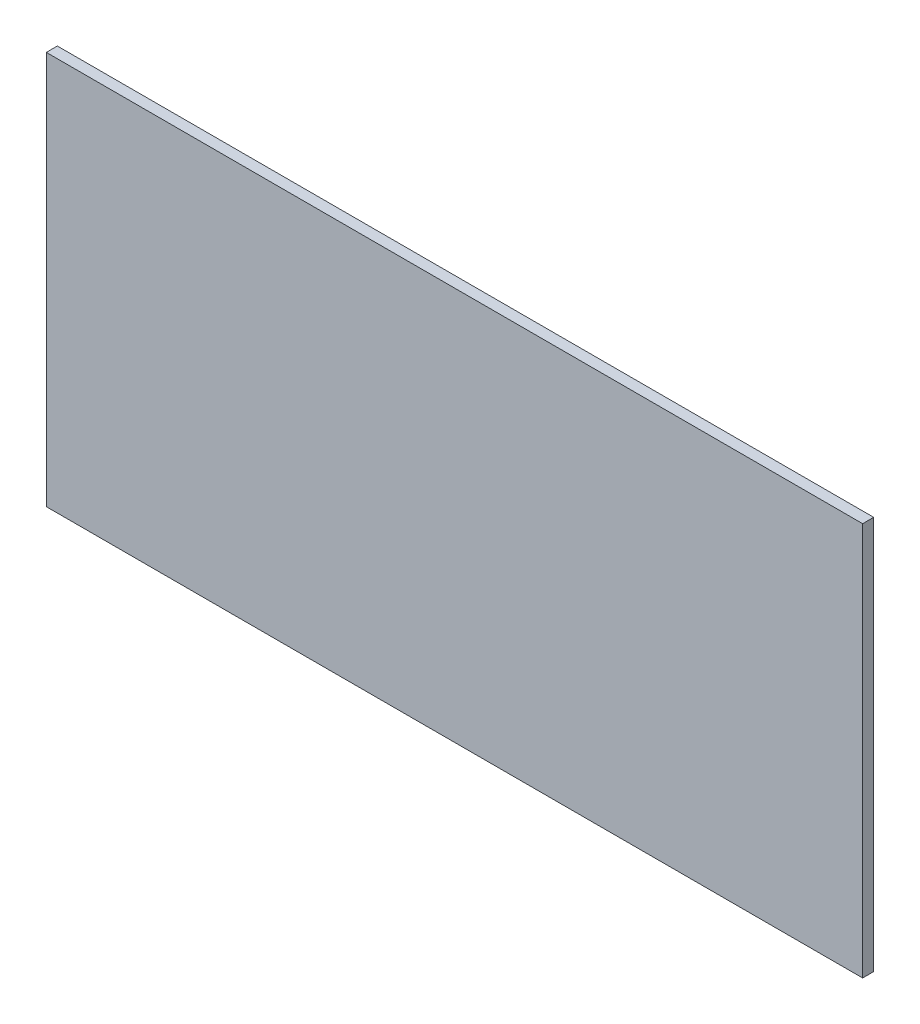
ISO-10303-21;
HEADER;
FILE_DESCRIPTION(('STEP AP214'),'2;1');
FILE_NAME('part.step','',(''),(''),'','','');
FILE_SCHEMA(('AUTOMOTIVE_DESIGN { 1 0 10303 214 1 1 1 1 }'));
ENDSEC;
DATA;
#1=APPLICATION_CONTEXT('core data for automotive mechanical design processes');
#2=APPLICATION_PROTOCOL_DEFINITION('international standard','automotive_design',2000,#1);
#3=PRODUCT_CONTEXT('',#1,'mechanical');
#4=PRODUCT('Part','Part','',(#3));
#5=PRODUCT_RELATED_PRODUCT_CATEGORY('part','',(#4));
#6=PRODUCT_DEFINITION_FORMATION('','',#4);
#7=PRODUCT_DEFINITION_CONTEXT('part definition',#1,'design');
#8=PRODUCT_DEFINITION('design','',#6,#7);
#9=PRODUCT_DEFINITION_SHAPE('','',#8);
#10=(LENGTH_UNIT() NAMED_UNIT(*) SI_UNIT(.MILLI.,.METRE.));
#11=(NAMED_UNIT(*) PLANE_ANGLE_UNIT() SI_UNIT($,.RADIAN.));
#12=(NAMED_UNIT(*) SI_UNIT($,.STERADIAN.) SOLID_ANGLE_UNIT());
#13=UNCERTAINTY_MEASURE_WITH_UNIT(LENGTH_MEASURE(1.E-05),#10,'distance_accuracy_value','');
#14=(GEOMETRIC_REPRESENTATION_CONTEXT(3) GLOBAL_UNCERTAINTY_ASSIGNED_CONTEXT((#13)) GLOBAL_UNIT_ASSIGNED_CONTEXT((#10,
#11,#12)) REPRESENTATION_CONTEXT('',''));
#15=CARTESIAN_POINT('',(0.,0.,0.));
#16=DIRECTION('',(0.,0.,1.));
#17=DIRECTION('',(1.,0.,0.));
#18=AXIS2_PLACEMENT_3D('',#15,#16,#17);
#19=CARTESIAN_POINT('',(0.,0.,3.));
#20=DIRECTION('',(1.,0.,0.));
#21=DIRECTION('',(0.,0.,-1.));
#22=AXIS2_PLACEMENT_3D('',#19,#20,#21);
#23=PLANE('',#22);
#24=DIRECTION('',(0.,-1.,0.));
#25=VECTOR('',#24,1.);
#26=CARTESIAN_POINT('',(0.,0.,0.));
#27=LINE('',#26,#25);
#28=CARTESIAN_POINT('',(0.,107.,0.));
#29=VERTEX_POINT('',#28);
#30=CARTESIAN_POINT('',(0.,0.,0.));
#31=VERTEX_POINT('',#30);
#32=EDGE_CURVE('E94',#29,#31,#27,.T.);
#33=ORIENTED_EDGE('',*,*,#32,.T.);
#34=DIRECTION('',(0.,0.,-1.));
#35=VECTOR('',#34,1.);
#36=CARTESIAN_POINT('',(0.,0.,3.));
#37=LINE('',#36,#35);
#38=CARTESIAN_POINT('',(0.,0.,3.));
#39=VERTEX_POINT('',#38);
#40=EDGE_CURVE('E11',#39,#31,#37,.T.);
#41=ORIENTED_EDGE('',*,*,#40,.F.);
#42=DIRECTION('',(0.,-1.,0.));
#43=VECTOR('',#42,1.);
#44=CARTESIAN_POINT('',(0.,0.,3.));
#45=LINE('',#44,#43);
#46=CARTESIAN_POINT('',(0.,107.,3.));
#47=VERTEX_POINT('',#46);
#48=EDGE_CURVE('E82',#47,#39,#45,.T.);
#49=ORIENTED_EDGE('',*,*,#48,.F.);
#50=DIRECTION('',(0.,0.,-1.));
#51=VECTOR('',#50,1.);
#52=CARTESIAN_POINT('',(0.,107.,3.));
#53=LINE('',#52,#51);
#54=EDGE_CURVE('E90',#47,#29,#53,.T.);
#55=ORIENTED_EDGE('',*,*,#54,.T.);
#56=EDGE_LOOP('',(#33,#41,#49,#55));
#57=FACE_BOUND('',#56,.T.);
#58=ADVANCED_FACE('F31',(#57),#23,.F.);
#59=CARTESIAN_POINT('',(0.,0.,3.));
#60=DIRECTION('',(0.,1.,0.));
#61=DIRECTION('',(0.,0.,1.));
#62=AXIS2_PLACEMENT_3D('',#59,#60,#61);
#63=PLANE('',#62);
#64=DIRECTION('',(1.,0.,0.));
#65=VECTOR('',#64,1.);
#66=CARTESIAN_POINT('',(0.,0.,0.));
#67=LINE('',#66,#65);
#68=CARTESIAN_POINT('',(222.,0.,0.));
#69=VERTEX_POINT('',#68);
#70=EDGE_CURVE('E86',#31,#69,#67,.T.);
#71=ORIENTED_EDGE('',*,*,#70,.T.);
#72=DIRECTION('',(0.,0.,-1.));
#73=VECTOR('',#72,1.);
#74=CARTESIAN_POINT('',(222.,0.,3.));
#75=LINE('',#74,#73);
#76=CARTESIAN_POINT('',(222.,0.,3.));
#77=VERTEX_POINT('',#76);
#78=EDGE_CURVE('E39',#77,#69,#75,.T.);
#79=ORIENTED_EDGE('',*,*,#78,.F.);
#80=DIRECTION('',(1.,0.,0.));
#81=VECTOR('',#80,1.);
#82=CARTESIAN_POINT('',(0.,0.,3.));
#83=LINE('',#82,#81);
#84=EDGE_CURVE('E77',#39,#77,#83,.T.);
#85=ORIENTED_EDGE('',*,*,#84,.F.);
#86=ORIENTED_EDGE('',*,*,#40,.T.);
#87=EDGE_LOOP('',(#71,#79,#85,#86));
#88=FACE_BOUND('',#87,.T.);
#89=ADVANCED_FACE('F85',(#88),#63,.F.);
#90=CARTESIAN_POINT('',(222.,0.,3.));
#91=DIRECTION('',(-1.,0.,0.));
#92=DIRECTION('',(0.,0.,1.));
#93=AXIS2_PLACEMENT_3D('',#90,#91,#92);
#94=PLANE('',#93);
#95=DIRECTION('',(0.,1.,0.));
#96=VECTOR('',#95,1.);
#97=CARTESIAN_POINT('',(222.,0.,0.));
#98=LINE('',#97,#96);
#99=CARTESIAN_POINT('',(222.,107.,0.));
#100=VERTEX_POINT('',#99);
#101=EDGE_CURVE('E64',#69,#100,#98,.T.);
#102=ORIENTED_EDGE('',*,*,#101,.T.);
#103=DIRECTION('',(0.,0.,-1.));
#104=VECTOR('',#103,1.);
#105=CARTESIAN_POINT('',(222.,107.,3.));
#106=LINE('',#105,#104);
#107=CARTESIAN_POINT('',(222.,107.,3.));
#108=VERTEX_POINT('',#107);
#109=EDGE_CURVE('E87',#108,#100,#106,.T.);
#110=ORIENTED_EDGE('',*,*,#109,.F.);
#111=DIRECTION('',(0.,1.,0.));
#112=VECTOR('',#111,1.);
#113=CARTESIAN_POINT('',(222.,0.,3.));
#114=LINE('',#113,#112);
#115=EDGE_CURVE('E80',#77,#108,#114,.T.);
#116=ORIENTED_EDGE('',*,*,#115,.F.);
#117=ORIENTED_EDGE('',*,*,#78,.T.);
#118=EDGE_LOOP('',(#102,#110,#116,#117));
#119=FACE_BOUND('',#118,.T.);
#120=ADVANCED_FACE('F88',(#119),#94,.F.);
#121=CARTESIAN_POINT('',(0.,107.,3.));
#122=DIRECTION('',(0.,-1.,0.));
#123=DIRECTION('',(0.,0.,-1.));
#124=AXIS2_PLACEMENT_3D('',#121,#122,#123);
#125=PLANE('',#124);
#126=DIRECTION('',(-1.,0.,0.));
#127=VECTOR('',#126,1.);
#128=CARTESIAN_POINT('',(0.,107.,0.));
#129=LINE('',#128,#127);
#130=EDGE_CURVE('E70',#100,#29,#129,.T.);
#131=ORIENTED_EDGE('',*,*,#130,.T.);
#132=ORIENTED_EDGE('',*,*,#54,.F.);
#133=DIRECTION('',(-1.,0.,0.));
#134=VECTOR('',#133,1.);
#135=CARTESIAN_POINT('',(0.,107.,3.));
#136=LINE('',#135,#134);
#137=EDGE_CURVE('E47',#108,#47,#136,.T.);
#138=ORIENTED_EDGE('',*,*,#137,.F.);
#139=ORIENTED_EDGE('',*,*,#109,.T.);
#140=EDGE_LOOP('',(#131,#132,#138,#139));
#141=FACE_BOUND('',#140,.T.);
#142=ADVANCED_FACE('F101',(#141),#125,.F.);
#143=CARTESIAN_POINT('',(0.,107.,3.));
#144=DIRECTION('',(0.,0.,-1.));
#145=DIRECTION('',(-1.,0.,0.));
#146=AXIS2_PLACEMENT_3D('',#143,#144,#145);
#147=PLANE('',#146);
#148=ORIENTED_EDGE('',*,*,#48,.T.);
#149=ORIENTED_EDGE('',*,*,#84,.T.);
#150=ORIENTED_EDGE('',*,*,#115,.T.);
#151=ORIENTED_EDGE('',*,*,#137,.T.);
#152=EDGE_LOOP('',(#148,#149,#150,#151));
#153=FACE_BOUND('',#152,.T.);
#154=ADVANCED_FACE('F78',(#153),#147,.F.);
#155=CARTESIAN_POINT('',(0.,107.,0.));
#156=DIRECTION('',(0.,0.,-1.));
#157=DIRECTION('',(-1.,0.,0.));
#158=AXIS2_PLACEMENT_3D('',#155,#156,#157);
#159=PLANE('',#158);
#160=ORIENTED_EDGE('',*,*,#32,.F.);
#161=ORIENTED_EDGE('',*,*,#130,.F.);
#162=ORIENTED_EDGE('',*,*,#101,.F.);
#163=ORIENTED_EDGE('',*,*,#70,.F.);
#164=EDGE_LOOP('',(#160,#161,#162,#163));
#165=FACE_BOUND('',#164,.T.);
#166=ADVANCED_FACE('F104',(#165),#159,.T.);
#167=CLOSED_SHELL('',(#58,#89,#120,#142,#154,#166));
#168=MANIFOLD_SOLID_BREP('B2',#167);
#169=ADVANCED_BREP_SHAPE_REPRESENTATION('',(#18,#168),#14);
#170=SHAPE_DEFINITION_REPRESENTATION(#9,#169);
ENDSEC;
END-ISO-10303-21;
